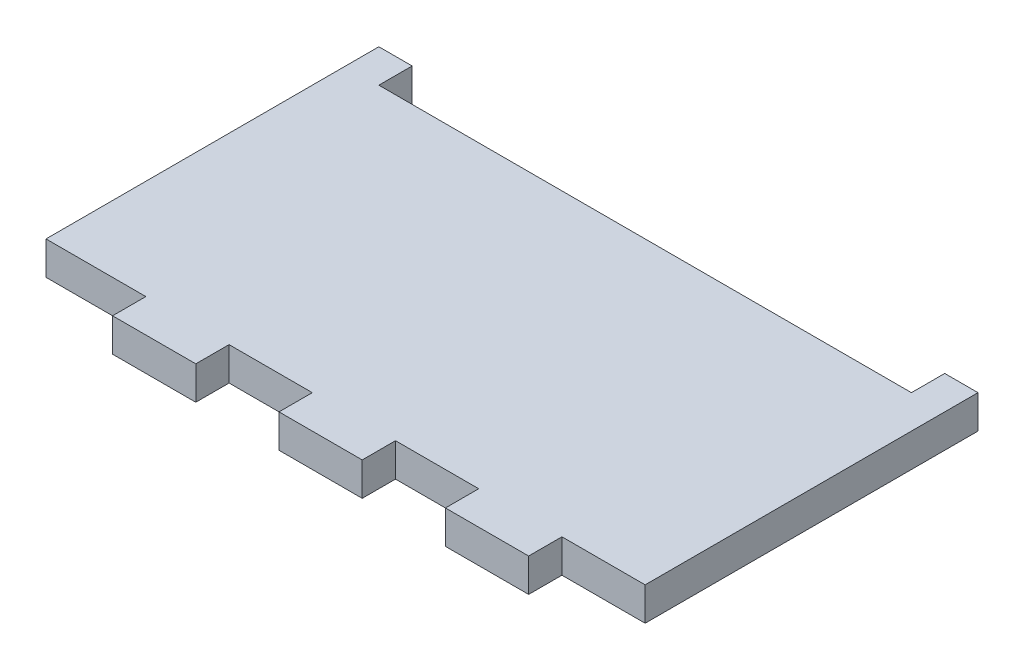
ISO-10303-21;
HEADER;
FILE_DESCRIPTION(('STEP AP214'),'2;1');
FILE_NAME('part.step','',(''),(''),'','','');
FILE_SCHEMA(('AUTOMOTIVE_DESIGN { 1 0 10303 214 1 1 1 1 }'));
ENDSEC;
DATA;
#1=APPLICATION_CONTEXT('core data for automotive mechanical design processes');
#2=APPLICATION_PROTOCOL_DEFINITION('international standard','automotive_design',2000,#1);
#3=PRODUCT_CONTEXT('',#1,'mechanical');
#4=PRODUCT('Part','Part','',(#3));
#5=PRODUCT_RELATED_PRODUCT_CATEGORY('part','',(#4));
#6=PRODUCT_DEFINITION_FORMATION('','',#4);
#7=PRODUCT_DEFINITION_CONTEXT('part definition',#1,'design');
#8=PRODUCT_DEFINITION('design','',#6,#7);
#9=PRODUCT_DEFINITION_SHAPE('','',#8);
#10=(LENGTH_UNIT() NAMED_UNIT(*) SI_UNIT(.MILLI.,.METRE.));
#11=(NAMED_UNIT(*) PLANE_ANGLE_UNIT() SI_UNIT($,.RADIAN.));
#12=(NAMED_UNIT(*) SI_UNIT($,.STERADIAN.) SOLID_ANGLE_UNIT());
#13=UNCERTAINTY_MEASURE_WITH_UNIT(LENGTH_MEASURE(1.E-05),#10,'distance_accuracy_value','');
#14=(GEOMETRIC_REPRESENTATION_CONTEXT(3) GLOBAL_UNCERTAINTY_ASSIGNED_CONTEXT((#13)) GLOBAL_UNIT_ASSIGNED_CONTEXT((#10,
#11,#12)) REPRESENTATION_CONTEXT('',''));
#15=CARTESIAN_POINT('',(0.,0.,0.));
#16=DIRECTION('',(0.,0.,1.));
#17=DIRECTION('',(1.,0.,0.));
#18=AXIS2_PLACEMENT_3D('',#15,#16,#17);
#19=CARTESIAN_POINT('',(0.,0.,18.));
#20=DIRECTION('',(0.,0.,-1.));
#21=DIRECTION('',(0.,-1.,0.));
#22=AXIS2_PLACEMENT_3D('',#19,#20,#21);
#23=PLANE('',#22);
#24=DIRECTION('',(0.,1.,0.));
#25=VECTOR('',#24,1.);
#26=CARTESIAN_POINT('',(-7.00000000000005,-7.49999999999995,18.0000000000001));
#27=LINE('',#26,#25);
#28=CARTESIAN_POINT('',(-7.00000000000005,-7.49999999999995,18.0000000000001));
#29=VERTEX_POINT('',#28);
#30=CARTESIAN_POINT('',(-7.00000000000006,-5.5,18.));
#31=VERTEX_POINT('',#30);
#32=EDGE_CURVE('E51',#29,#31,#27,.T.);
#33=ORIENTED_EDGE('',*,*,#32,.F.);
#34=DIRECTION('',(-1.,0.,0.));
#35=VECTOR('',#34,1.);
#36=CARTESIAN_POINT('',(18.0000000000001,-7.5,18.0000000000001));
#37=LINE('',#36,#35);
#38=CARTESIAN_POINT('',(-2.00000000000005,-7.49999999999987,18.));
#39=VERTEX_POINT('',#38);
#40=EDGE_CURVE('E305',#39,#29,#37,.T.);
#41=ORIENTED_EDGE('',*,*,#40,.F.);
#42=DIRECTION('',(0.,-1.,0.));
#43=VECTOR('',#42,1.);
#44=CARTESIAN_POINT('',(-2.00000000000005,-7.49999999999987,18.));
#45=LINE('',#44,#43);
#46=CARTESIAN_POINT('',(-2.00000000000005,-5.49999999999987,18.));
#47=VERTEX_POINT('',#46);
#48=EDGE_CURVE('E195',#47,#39,#45,.T.);
#49=ORIENTED_EDGE('',*,*,#48,.F.);
#50=DIRECTION('',(1.,0.,0.));
#51=VECTOR('',#50,1.);
#52=CARTESIAN_POINT('',(18.0000000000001,-5.5,18.0000000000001));
#53=LINE('',#52,#51);
#54=EDGE_CURVE('E291',#31,#47,#53,.T.);
#55=ORIENTED_EDGE('',*,*,#54,.F.);
#56=EDGE_LOOP('',(#33,#41,#49,#55));
#57=FACE_BOUND('',#56,.T.);
#58=ADVANCED_FACE('F34',(#57),#23,.F.);
#59=DIRECTION('',(0.,-1.,0.));
#60=VECTOR('',#59,1.);
#61=CARTESIAN_POINT('',(-12.0000000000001,-7.49999999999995,18.0000000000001));
#62=LINE('',#61,#60);
#63=CARTESIAN_POINT('',(-12.0000000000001,-5.49999999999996,18.0000000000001));
#64=VERTEX_POINT('',#63);
#65=CARTESIAN_POINT('',(-12.0000000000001,-7.49999999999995,18.0000000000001));
#66=VERTEX_POINT('',#65);
#67=EDGE_CURVE('E191',#64,#66,#62,.T.);
#68=ORIENTED_EDGE('',*,*,#67,.F.);
#69=CARTESIAN_POINT('',(-18.,-5.50000000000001,18.));
#70=VERTEX_POINT('',#69);
#71=EDGE_CURVE('E43',#70,#64,#53,.T.);
#72=ORIENTED_EDGE('',*,*,#71,.F.);
#73=DIRECTION('',(0.,1.,0.));
#74=VECTOR('',#73,1.);
#75=CARTESIAN_POINT('',(-18.,-7.50000000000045,18.));
#76=LINE('',#75,#74);
#77=CARTESIAN_POINT('',(-18.,-7.5,18.0000000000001));
#78=VERTEX_POINT('',#77);
#79=EDGE_CURVE('E287',#78,#70,#76,.T.);
#80=ORIENTED_EDGE('',*,*,#79,.F.);
#81=EDGE_CURVE('E303',#66,#78,#37,.T.);
#82=ORIENTED_EDGE('',*,*,#81,.F.);
#83=EDGE_LOOP('',(#68,#72,#80,#82));
#84=FACE_BOUND('',#83,.T.);
#85=ADVANCED_FACE('F365',(#84),#23,.F.);
#86=DIRECTION('',(0.,1.,0.));
#87=VECTOR('',#86,1.);
#88=CARTESIAN_POINT('',(2.99999999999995,-7.49999999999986,18.));
#89=LINE('',#88,#87);
#90=CARTESIAN_POINT('',(2.99999999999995,-7.49999999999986,18.));
#91=VERTEX_POINT('',#90);
#92=CARTESIAN_POINT('',(2.99999999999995,-5.5,18.0000000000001));
#93=VERTEX_POINT('',#92);
#94=EDGE_CURVE('E59',#91,#93,#89,.T.);
#95=ORIENTED_EDGE('',*,*,#94,.F.);
#96=CARTESIAN_POINT('',(7.99999999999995,-7.49999999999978,18.));
#97=VERTEX_POINT('',#96);
#98=EDGE_CURVE('E311',#97,#91,#37,.T.);
#99=ORIENTED_EDGE('',*,*,#98,.F.);
#100=DIRECTION('',(0.,-1.,0.));
#101=VECTOR('',#100,1.);
#102=CARTESIAN_POINT('',(7.99999999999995,-7.49999999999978,18.));
#103=LINE('',#102,#101);
#104=CARTESIAN_POINT('',(7.99999999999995,-5.5,18.0000000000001));
#105=VERTEX_POINT('',#104);
#106=EDGE_CURVE('E226',#105,#97,#103,.T.);
#107=ORIENTED_EDGE('',*,*,#106,.F.);
#108=EDGE_CURVE('E330',#93,#105,#53,.T.);
#109=ORIENTED_EDGE('',*,*,#108,.F.);
#110=EDGE_LOOP('',(#95,#99,#107,#109));
#111=FACE_BOUND('',#110,.T.);
#112=ADVANCED_FACE('F324',(#111),#23,.F.);
#113=DIRECTION('',(0.,1.,0.));
#114=VECTOR('',#113,1.);
#115=CARTESIAN_POINT('',(12.9999999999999,-7.49999999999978,18.));
#116=LINE('',#115,#114);
#117=CARTESIAN_POINT('',(12.9999999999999,-7.5,18.0000000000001));
#118=VERTEX_POINT('',#117);
#119=CARTESIAN_POINT('',(12.9999999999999,-5.5,18.0000000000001));
#120=VERTEX_POINT('',#119);
#121=EDGE_CURVE('E221',#118,#120,#116,.T.);
#122=ORIENTED_EDGE('',*,*,#121,.F.);
#123=CARTESIAN_POINT('',(18.,-7.5,18.0000000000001));
#124=VERTEX_POINT('',#123);
#125=EDGE_CURVE('E38',#124,#118,#37,.T.);
#126=ORIENTED_EDGE('',*,*,#125,.F.);
#127=DIRECTION('',(0.,-1.,0.));
#128=VECTOR('',#127,1.);
#129=CARTESIAN_POINT('',(18.,-7.50000000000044,18.0000000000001));
#130=LINE('',#129,#128);
#131=CARTESIAN_POINT('',(18.,-5.5,18.0000000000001));
#132=VERTEX_POINT('',#131);
#133=EDGE_CURVE('E11',#132,#124,#130,.T.);
#134=ORIENTED_EDGE('',*,*,#133,.F.);
#135=EDGE_CURVE('E290',#120,#132,#53,.T.);
#136=ORIENTED_EDGE('',*,*,#135,.F.);
#137=EDGE_LOOP('',(#122,#126,#134,#136));
#138=FACE_BOUND('',#137,.T.);
#139=ADVANCED_FACE('F334',(#138),#23,.F.);
#140=CARTESIAN_POINT('',(0.,0.,0.));
#141=DIRECTION('',(0.,0.,1.));
#142=DIRECTION('',(1.,0.,0.));
#143=AXIS2_PLACEMENT_3D('',#140,#141,#142);
#144=PLANE('',#143);
#145=DIRECTION('',(-1.,0.,0.));
#146=VECTOR('',#145,1.);
#147=CARTESIAN_POINT('',(18.,-5.5,0.));
#148=LINE('',#147,#146);
#149=CARTESIAN_POINT('',(16.,-5.5,0.));
#150=VERTEX_POINT('',#149);
#151=CARTESIAN_POINT('',(-16.,-5.5,0.));
#152=VERTEX_POINT('',#151);
#153=EDGE_CURVE('E286',#150,#152,#148,.T.);
#154=ORIENTED_EDGE('',*,*,#153,.F.);
#155=DIRECTION('',(0.,-1.,0.));
#156=VECTOR('',#155,1.);
#157=CARTESIAN_POINT('',(16.,-5.5,0.));
#158=LINE('',#157,#156);
#159=CARTESIAN_POINT('',(16.,-7.5,0.));
#160=VERTEX_POINT('',#159);
#161=EDGE_CURVE('E248',#150,#160,#158,.T.);
#162=ORIENTED_EDGE('',*,*,#161,.T.);
#163=DIRECTION('',(1.,0.,0.));
#164=VECTOR('',#163,1.);
#165=CARTESIAN_POINT('',(18.,-7.5,0.));
#166=LINE('',#165,#164);
#167=CARTESIAN_POINT('',(-16.,-7.5,0.));
#168=VERTEX_POINT('',#167);
#169=EDGE_CURVE('E294',#168,#160,#166,.T.);
#170=ORIENTED_EDGE('',*,*,#169,.F.);
#171=DIRECTION('',(0.,-1.,0.));
#172=VECTOR('',#171,1.);
#173=CARTESIAN_POINT('',(-16.,-5.5,0.));
#174=LINE('',#173,#172);
#175=EDGE_CURVE('E267',#152,#168,#174,.T.);
#176=ORIENTED_EDGE('',*,*,#175,.F.);
#177=EDGE_LOOP('',(#154,#162,#170,#176));
#178=FACE_BOUND('',#177,.T.);
#179=ADVANCED_FACE('F349',(#178),#144,.F.);
#180=CARTESIAN_POINT('',(18.,-7.5,54.05551275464));
#181=DIRECTION('',(0.,1.,0.));
#182=DIRECTION('',(-1.,0.,0.));
#183=AXIS2_PLACEMENT_3D('',#180,#181,#182);
#184=PLANE('',#183);
#185=DIRECTION('',(0.,0.,-1.));
#186=VECTOR('',#185,1.);
#187=CARTESIAN_POINT('',(-18.,-7.5,54.05551275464));
#188=LINE('',#187,#186);
#189=CARTESIAN_POINT('',(-18.,-7.5,-2.));
#190=VERTEX_POINT('',#189);
#191=EDGE_CURVE('E299',#78,#190,#188,.T.);
#192=ORIENTED_EDGE('',*,*,#191,.T.);
#193=DIRECTION('',(-1.,0.,0.));
#194=VECTOR('',#193,1.);
#195=CARTESIAN_POINT('',(-18.,-7.5,-2.));
#196=LINE('',#195,#194);
#197=CARTESIAN_POINT('',(-16.,-7.5,-2.));
#198=VERTEX_POINT('',#197);
#199=EDGE_CURVE('E275',#198,#190,#196,.T.);
#200=ORIENTED_EDGE('',*,*,#199,.F.);
#201=DIRECTION('',(0.,0.,1.));
#202=VECTOR('',#201,1.);
#203=CARTESIAN_POINT('',(-16.,-7.5,-2.));
#204=LINE('',#203,#202);
#205=EDGE_CURVE('E278',#198,#168,#204,.T.);
#206=ORIENTED_EDGE('',*,*,#205,.T.);
#207=ORIENTED_EDGE('',*,*,#169,.T.);
#208=DIRECTION('',(0.,0.,1.));
#209=VECTOR('',#208,1.);
#210=CARTESIAN_POINT('',(16.,-7.5,-2.));
#211=LINE('',#210,#209);
#212=CARTESIAN_POINT('',(16.,-7.5,-2.));
#213=VERTEX_POINT('',#212);
#214=EDGE_CURVE('E265',#213,#160,#211,.T.);
#215=ORIENTED_EDGE('',*,*,#214,.F.);
#216=DIRECTION('',(1.,0.,0.));
#217=VECTOR('',#216,1.);
#218=CARTESIAN_POINT('',(18.,-7.5,-2.));
#219=LINE('',#218,#217);
#220=CARTESIAN_POINT('',(18.,-7.5,-2.));
#221=VERTEX_POINT('',#220);
#222=EDGE_CURVE('E252',#213,#221,#219,.T.);
#223=ORIENTED_EDGE('',*,*,#222,.T.);
#224=DIRECTION('',(0.,0.,-1.));
#225=VECTOR('',#224,1.);
#226=CARTESIAN_POINT('',(18.,-7.5,54.05551275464));
#227=LINE('',#226,#225);
#228=EDGE_CURVE('E297',#124,#221,#227,.T.);
#229=ORIENTED_EDGE('',*,*,#228,.F.);
#230=ORIENTED_EDGE('',*,*,#125,.T.);
#231=DIRECTION('',(0.,0.,-1.));
#232=VECTOR('',#231,1.);
#233=CARTESIAN_POINT('',(12.9999999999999,-7.49999999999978,20.));
#234=LINE('',#233,#232);
#235=CARTESIAN_POINT('',(12.9999999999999,-7.49999999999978,20.));
#236=VERTEX_POINT('',#235);
#237=EDGE_CURVE('E232',#236,#118,#234,.T.);
#238=ORIENTED_EDGE('',*,*,#237,.F.);
#239=DIRECTION('',(1.,0.,0.));
#240=VECTOR('',#239,1.);
#241=CARTESIAN_POINT('',(12.9999999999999,-7.49999999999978,20.));
#242=LINE('',#241,#240);
#243=CARTESIAN_POINT('',(7.99999999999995,-7.49999999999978,20.));
#244=VERTEX_POINT('',#243);
#245=EDGE_CURVE('E230',#244,#236,#242,.T.);
#246=ORIENTED_EDGE('',*,*,#245,.F.);
#247=DIRECTION('',(0.,0.,-1.));
#248=VECTOR('',#247,1.);
#249=CARTESIAN_POINT('',(7.99999999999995,-7.49999999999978,20.));
#250=LINE('',#249,#248);
#251=EDGE_CURVE('E239',#244,#97,#250,.T.);
#252=ORIENTED_EDGE('',*,*,#251,.T.);
#253=ORIENTED_EDGE('',*,*,#98,.T.);
#254=DIRECTION('',(0.,0.,-1.));
#255=VECTOR('',#254,1.);
#256=CARTESIAN_POINT('',(2.99999999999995,-7.49999999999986,20.));
#257=LINE('',#256,#255);
#258=CARTESIAN_POINT('',(2.99999999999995,-7.49999999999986,20.));
#259=VERTEX_POINT('',#258);
#260=EDGE_CURVE('E209',#259,#91,#257,.T.);
#261=ORIENTED_EDGE('',*,*,#260,.F.);
#262=DIRECTION('',(1.,0.,0.));
#263=VECTOR('',#262,1.);
#264=CARTESIAN_POINT('',(2.99999999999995,-7.49999999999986,20.));
#265=LINE('',#264,#263);
#266=CARTESIAN_POINT('',(-2.00000000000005,-7.49999999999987,20.));
#267=VERTEX_POINT('',#266);
#268=EDGE_CURVE('E208',#267,#259,#265,.T.);
#269=ORIENTED_EDGE('',*,*,#268,.F.);
#270=DIRECTION('',(0.,0.,-1.));
#271=VECTOR('',#270,1.);
#272=CARTESIAN_POINT('',(-2.00000000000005,-7.49999999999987,20.));
#273=LINE('',#272,#271);
#274=EDGE_CURVE('E213',#267,#39,#273,.T.);
#275=ORIENTED_EDGE('',*,*,#274,.T.);
#276=ORIENTED_EDGE('',*,*,#40,.T.);
#277=DIRECTION('',(0.,0.,-1.));
#278=VECTOR('',#277,1.);
#279=CARTESIAN_POINT('',(-7.00000000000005,-7.49999999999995,20.0000000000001));
#280=LINE('',#279,#278);
#281=CARTESIAN_POINT('',(-7.00000000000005,-7.49999999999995,20.0000000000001));
#282=VERTEX_POINT('',#281);
#283=EDGE_CURVE('E372',#282,#29,#280,.T.);
#284=ORIENTED_EDGE('',*,*,#283,.F.);
#285=DIRECTION('',(1.,0.,0.));
#286=VECTOR('',#285,1.);
#287=CARTESIAN_POINT('',(-7.00000000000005,-7.49999999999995,20.0000000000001));
#288=LINE('',#287,#286);
#289=CARTESIAN_POINT('',(-12.0000000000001,-7.49999999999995,20.0000000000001));
#290=VERTEX_POINT('',#289);
#291=EDGE_CURVE('E189',#290,#282,#288,.T.);
#292=ORIENTED_EDGE('',*,*,#291,.F.);
#293=DIRECTION('',(0.,0.,-1.));
#294=VECTOR('',#293,1.);
#295=CARTESIAN_POINT('',(-12.0000000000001,-7.49999999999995,20.0000000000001));
#296=LINE('',#295,#294);
#297=EDGE_CURVE('E197',#290,#66,#296,.T.);
#298=ORIENTED_EDGE('',*,*,#297,.T.);
#299=ORIENTED_EDGE('',*,*,#81,.T.);
#300=EDGE_LOOP('',(#192,#200,#206,#207,#215,#223,#229,#230,#238,#246,#252,#253,#261,#269,#275,
#276,#284,#292,#298,#299));
#301=FACE_BOUND('',#300,.T.);
#302=ADVANCED_FACE('F317',(#301),#184,.F.);
#303=CARTESIAN_POINT('',(-18.,-7.5,54.05551275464));
#304=DIRECTION('',(1.,0.,0.));
#305=DIRECTION('',(0.,1.,0.));
#306=AXIS2_PLACEMENT_3D('',#303,#304,#305);
#307=PLANE('',#306);
#308=DIRECTION('',(0.,0.,-1.));
#309=VECTOR('',#308,1.);
#310=CARTESIAN_POINT('',(-18.,-5.5,54.05551275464));
#311=LINE('',#310,#309);
#312=CARTESIAN_POINT('',(-18.,-5.5,-2.));
#313=VERTEX_POINT('',#312);
#314=EDGE_CURVE('E301',#70,#313,#311,.T.);
#315=ORIENTED_EDGE('',*,*,#314,.T.);
#316=DIRECTION('',(0.,1.,0.));
#317=VECTOR('',#316,1.);
#318=CARTESIAN_POINT('',(-18.,-5.5,-2.));
#319=LINE('',#318,#317);
#320=EDGE_CURVE('E268',#190,#313,#319,.T.);
#321=ORIENTED_EDGE('',*,*,#320,.F.);
#322=ORIENTED_EDGE('',*,*,#191,.F.);
#323=ORIENTED_EDGE('',*,*,#79,.T.);
#324=EDGE_LOOP('',(#315,#321,#322,#323));
#325=FACE_BOUND('',#324,.T.);
#326=ADVANCED_FACE('F362',(#325),#307,.F.);
#327=CARTESIAN_POINT('',(18.,-5.5,54.05551275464));
#328=DIRECTION('',(0.,-1.,0.));
#329=DIRECTION('',(1.,0.,0.));
#330=AXIS2_PLACEMENT_3D('',#327,#328,#329);
#331=PLANE('',#330);
#332=DIRECTION('',(0.,0.,-1.));
#333=VECTOR('',#332,1.);
#334=CARTESIAN_POINT('',(18.,-5.5,54.05551275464));
#335=LINE('',#334,#333);
#336=CARTESIAN_POINT('',(18.,-5.5,-2.));
#337=VERTEX_POINT('',#336);
#338=EDGE_CURVE('E302',#132,#337,#335,.T.);
#339=ORIENTED_EDGE('',*,*,#338,.T.);
#340=DIRECTION('',(-1.,0.,0.));
#341=VECTOR('',#340,1.);
#342=CARTESIAN_POINT('',(18.,-5.5,-2.));
#343=LINE('',#342,#341);
#344=CARTESIAN_POINT('',(16.,-5.5,-2.));
#345=VERTEX_POINT('',#344);
#346=EDGE_CURVE('E258',#337,#345,#343,.T.);
#347=ORIENTED_EDGE('',*,*,#346,.T.);
#348=DIRECTION('',(0.,0.,1.));
#349=VECTOR('',#348,1.);
#350=CARTESIAN_POINT('',(16.,-5.5,-2.));
#351=LINE('',#350,#349);
#352=EDGE_CURVE('E261',#345,#150,#351,.T.);
#353=ORIENTED_EDGE('',*,*,#352,.T.);
#354=ORIENTED_EDGE('',*,*,#153,.T.);
#355=DIRECTION('',(0.,0.,1.));
#356=VECTOR('',#355,1.);
#357=CARTESIAN_POINT('',(-16.,-5.5,-2.));
#358=LINE('',#357,#356);
#359=CARTESIAN_POINT('',(-16.,-5.5,-2.));
#360=VERTEX_POINT('',#359);
#361=EDGE_CURVE('E283',#360,#152,#358,.T.);
#362=ORIENTED_EDGE('',*,*,#361,.F.);
#363=DIRECTION('',(1.,0.,0.));
#364=VECTOR('',#363,1.);
#365=CARTESIAN_POINT('',(-18.,-5.5,-2.));
#366=LINE('',#365,#364);
#367=EDGE_CURVE('E271',#313,#360,#366,.T.);
#368=ORIENTED_EDGE('',*,*,#367,.F.);
#369=ORIENTED_EDGE('',*,*,#314,.F.);
#370=ORIENTED_EDGE('',*,*,#71,.T.);
#371=DIRECTION('',(0.,0.,-1.));
#372=VECTOR('',#371,1.);
#373=CARTESIAN_POINT('',(-12.0000000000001,-5.49999999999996,20.0000000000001));
#374=LINE('',#373,#372);
#375=CARTESIAN_POINT('',(-12.0000000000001,-5.49999999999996,20.0000000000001));
#376=VERTEX_POINT('',#375);
#377=EDGE_CURVE('E180',#376,#64,#374,.T.);
#378=ORIENTED_EDGE('',*,*,#377,.F.);
#379=DIRECTION('',(-1.,0.,0.));
#380=VECTOR('',#379,1.);
#381=CARTESIAN_POINT('',(-7.00000000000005,-5.49999999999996,20.0000000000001));
#382=LINE('',#381,#380);
#383=CARTESIAN_POINT('',(-7.00000000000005,-5.49999999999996,20.0000000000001));
#384=VERTEX_POINT('',#383);
#385=EDGE_CURVE('E174',#384,#376,#382,.T.);
#386=ORIENTED_EDGE('',*,*,#385,.F.);
#387=DIRECTION('',(0.,0.,-1.));
#388=VECTOR('',#387,1.);
#389=CARTESIAN_POINT('',(-7.00000000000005,-5.49999999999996,20.0000000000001));
#390=LINE('',#389,#388);
#391=EDGE_CURVE('E177',#384,#31,#390,.T.);
#392=ORIENTED_EDGE('',*,*,#391,.T.);
#393=ORIENTED_EDGE('',*,*,#54,.T.);
#394=DIRECTION('',(0.,0.,-1.));
#395=VECTOR('',#394,1.);
#396=CARTESIAN_POINT('',(-2.00000000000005,-5.49999999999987,20.));
#397=LINE('',#396,#395);
#398=CARTESIAN_POINT('',(-2.00000000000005,-5.49999999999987,20.));
#399=VERTEX_POINT('',#398);
#400=EDGE_CURVE('E216',#399,#47,#397,.T.);
#401=ORIENTED_EDGE('',*,*,#400,.F.);
#402=DIRECTION('',(-1.,0.,0.));
#403=VECTOR('',#402,1.);
#404=CARTESIAN_POINT('',(2.99999999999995,-5.49999999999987,20.));
#405=LINE('',#404,#403);
#406=CARTESIAN_POINT('',(2.99999999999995,-5.49999999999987,20.));
#407=VERTEX_POINT('',#406);
#408=EDGE_CURVE('E204',#407,#399,#405,.T.);
#409=ORIENTED_EDGE('',*,*,#408,.F.);
#410=DIRECTION('',(0.,0.,-1.));
#411=VECTOR('',#410,1.);
#412=CARTESIAN_POINT('',(2.99999999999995,-5.49999999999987,20.));
#413=LINE('',#412,#411);
#414=EDGE_CURVE('E219',#407,#93,#413,.T.);
#415=ORIENTED_EDGE('',*,*,#414,.T.);
#416=ORIENTED_EDGE('',*,*,#108,.T.);
#417=DIRECTION('',(0.,0.,-1.));
#418=VECTOR('',#417,1.);
#419=CARTESIAN_POINT('',(7.99999999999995,-5.49999999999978,20.));
#420=LINE('',#419,#418);
#421=CARTESIAN_POINT('',(7.99999999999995,-5.49999999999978,20.));
#422=VERTEX_POINT('',#421);
#423=EDGE_CURVE('E242',#422,#105,#420,.T.);
#424=ORIENTED_EDGE('',*,*,#423,.F.);
#425=DIRECTION('',(-1.,0.,0.));
#426=VECTOR('',#425,1.);
#427=CARTESIAN_POINT('',(12.9999999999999,-5.49999999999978,20.));
#428=LINE('',#427,#426);
#429=CARTESIAN_POINT('',(12.9999999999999,-5.49999999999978,20.));
#430=VERTEX_POINT('',#429);
#431=EDGE_CURVE('E225',#430,#422,#428,.T.);
#432=ORIENTED_EDGE('',*,*,#431,.F.);
#433=DIRECTION('',(0.,0.,-1.));
#434=VECTOR('',#433,1.);
#435=CARTESIAN_POINT('',(12.9999999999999,-5.49999999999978,20.));
#436=LINE('',#435,#434);
#437=EDGE_CURVE('E245',#430,#120,#436,.T.);
#438=ORIENTED_EDGE('',*,*,#437,.T.);
#439=ORIENTED_EDGE('',*,*,#135,.T.);
#440=EDGE_LOOP('',(#339,#347,#353,#354,#362,#368,#369,#370,#378,#386,#392,#393,#401,#409,#415,
#416,#424,#432,#438,#439));
#441=FACE_BOUND('',#440,.T.);
#442=ADVANCED_FACE('F176',(#441),#331,.F.);
#443=CARTESIAN_POINT('',(18.,-7.5,54.05551275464));
#444=DIRECTION('',(-1.,0.,0.));
#445=DIRECTION('',(0.,0.,1.));
#446=AXIS2_PLACEMENT_3D('',#443,#444,#445);
#447=PLANE('',#446);
#448=ORIENTED_EDGE('',*,*,#338,.F.);
#449=ORIENTED_EDGE('',*,*,#133,.T.);
#450=ORIENTED_EDGE('',*,*,#228,.T.);
#451=DIRECTION('',(0.,1.,0.));
#452=VECTOR('',#451,1.);
#453=CARTESIAN_POINT('',(18.,-5.5,-2.));
#454=LINE('',#453,#452);
#455=EDGE_CURVE('E249',#221,#337,#454,.T.);
#456=ORIENTED_EDGE('',*,*,#455,.T.);
#457=EDGE_LOOP('',(#448,#449,#450,#456));
#458=FACE_BOUND('',#457,.T.);
#459=ADVANCED_FACE('F36',(#458),#447,.F.);
#460=CARTESIAN_POINT('',(-16.,-5.5,-2.));
#461=DIRECTION('',(-1.,0.,0.));
#462=DIRECTION('',(0.,0.,1.));
#463=AXIS2_PLACEMENT_3D('',#460,#461,#462);
#464=PLANE('',#463);
#465=ORIENTED_EDGE('',*,*,#175,.T.);
#466=ORIENTED_EDGE('',*,*,#205,.F.);
#467=DIRECTION('',(0.,-1.,0.));
#468=VECTOR('',#467,1.);
#469=CARTESIAN_POINT('',(-16.,-5.5,-2.));
#470=LINE('',#469,#468);
#471=EDGE_CURVE('E273',#360,#198,#470,.T.);
#472=ORIENTED_EDGE('',*,*,#471,.F.);
#473=ORIENTED_EDGE('',*,*,#361,.T.);
#474=EDGE_LOOP('',(#465,#466,#472,#473));
#475=FACE_BOUND('',#474,.T.);
#476=ADVANCED_FACE('F353',(#475),#464,.F.);
#477=CARTESIAN_POINT('',(0.,0.,-2.));
#478=DIRECTION('',(0.,0.,1.));
#479=DIRECTION('',(1.,0.,0.));
#480=AXIS2_PLACEMENT_3D('',#477,#478,#479);
#481=PLANE('',#480);
#482=ORIENTED_EDGE('',*,*,#320,.T.);
#483=ORIENTED_EDGE('',*,*,#367,.T.);
#484=ORIENTED_EDGE('',*,*,#471,.T.);
#485=ORIENTED_EDGE('',*,*,#199,.T.);
#486=EDGE_LOOP('',(#482,#483,#484,#485));
#487=FACE_BOUND('',#486,.T.);
#488=ADVANCED_FACE('F358',(#487),#481,.F.);
#489=CARTESIAN_POINT('',(16.,-5.5,-2.));
#490=DIRECTION('',(-1.,0.,0.));
#491=DIRECTION('',(0.,0.,1.));
#492=AXIS2_PLACEMENT_3D('',#489,#490,#491);
#493=PLANE('',#492);
#494=ORIENTED_EDGE('',*,*,#161,.F.);
#495=ORIENTED_EDGE('',*,*,#352,.F.);
#496=DIRECTION('',(0.,-1.,0.));
#497=VECTOR('',#496,1.);
#498=CARTESIAN_POINT('',(16.,-5.5,-2.));
#499=LINE('',#498,#497);
#500=EDGE_CURVE('E255',#345,#213,#499,.T.);
#501=ORIENTED_EDGE('',*,*,#500,.T.);
#502=ORIENTED_EDGE('',*,*,#214,.T.);
#503=EDGE_LOOP('',(#494,#495,#501,#502));
#504=FACE_BOUND('',#503,.T.);
#505=ADVANCED_FACE('F347',(#504),#493,.T.);
#506=CARTESIAN_POINT('',(0.,0.,-2.));
#507=DIRECTION('',(0.,0.,1.));
#508=DIRECTION('',(-1.,0.,0.));
#509=AXIS2_PLACEMENT_3D('',#506,#507,#508);
#510=PLANE('',#509);
#511=ORIENTED_EDGE('',*,*,#455,.F.);
#512=ORIENTED_EDGE('',*,*,#222,.F.);
#513=ORIENTED_EDGE('',*,*,#500,.F.);
#514=ORIENTED_EDGE('',*,*,#346,.F.);
#515=EDGE_LOOP('',(#511,#512,#513,#514));
#516=FACE_BOUND('',#515,.T.);
#517=ADVANCED_FACE('F341',(#516),#510,.F.);
#518=CARTESIAN_POINT('',(12.9999999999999,-7.49999999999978,20.));
#519=DIRECTION('',(-1.,0.,0.));
#520=DIRECTION('',(0.,0.,1.));
#521=AXIS2_PLACEMENT_3D('',#518,#519,#520);
#522=PLANE('',#521);
#523=ORIENTED_EDGE('',*,*,#121,.T.);
#524=ORIENTED_EDGE('',*,*,#437,.F.);
#525=DIRECTION('',(0.,1.,0.));
#526=VECTOR('',#525,1.);
#527=CARTESIAN_POINT('',(12.9999999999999,-7.49999999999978,20.));
#528=LINE('',#527,#526);
#529=EDGE_CURVE('E222',#236,#430,#528,.T.);
#530=ORIENTED_EDGE('',*,*,#529,.F.);
#531=ORIENTED_EDGE('',*,*,#237,.T.);
#532=EDGE_LOOP('',(#523,#524,#530,#531));
#533=FACE_BOUND('',#532,.T.);
#534=ADVANCED_FACE('F430',(#533),#522,.F.);
#535=CARTESIAN_POINT('',(7.99999999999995,-7.49999999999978,20.));
#536=DIRECTION('',(1.,0.,0.));
#537=DIRECTION('',(0.,0.,-1.));
#538=AXIS2_PLACEMENT_3D('',#535,#536,#537);
#539=PLANE('',#538);
#540=ORIENTED_EDGE('',*,*,#106,.T.);
#541=ORIENTED_EDGE('',*,*,#251,.F.);
#542=DIRECTION('',(0.,-1.,0.));
#543=VECTOR('',#542,1.);
#544=CARTESIAN_POINT('',(7.99999999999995,-7.49999999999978,20.));
#545=LINE('',#544,#543);
#546=EDGE_CURVE('E228',#422,#244,#545,.T.);
#547=ORIENTED_EDGE('',*,*,#546,.F.);
#548=ORIENTED_EDGE('',*,*,#423,.T.);
#549=EDGE_LOOP('',(#540,#541,#547,#548));
#550=FACE_BOUND('',#549,.T.);
#551=ADVANCED_FACE('F327',(#550),#539,.F.);
#552=CARTESIAN_POINT('',(0.,0.,20.));
#553=DIRECTION('',(0.,0.,1.));
#554=DIRECTION('',(1.,0.,0.));
#555=AXIS2_PLACEMENT_3D('',#552,#553,#554);
#556=PLANE('',#555);
#557=ORIENTED_EDGE('',*,*,#529,.T.);
#558=ORIENTED_EDGE('',*,*,#431,.T.);
#559=ORIENTED_EDGE('',*,*,#546,.T.);
#560=ORIENTED_EDGE('',*,*,#245,.T.);
#561=EDGE_LOOP('',(#557,#558,#559,#560));
#562=FACE_BOUND('',#561,.T.);
#563=ADVANCED_FACE('F414',(#562),#556,.T.);
#564=CARTESIAN_POINT('',(2.99999999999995,-7.49999999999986,20.));
#565=DIRECTION('',(-1.,0.,0.));
#566=DIRECTION('',(0.,0.,1.));
#567=AXIS2_PLACEMENT_3D('',#564,#565,#566);
#568=PLANE('',#567);
#569=ORIENTED_EDGE('',*,*,#94,.T.);
#570=ORIENTED_EDGE('',*,*,#414,.F.);
#571=DIRECTION('',(0.,1.,0.));
#572=VECTOR('',#571,1.);
#573=CARTESIAN_POINT('',(2.99999999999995,-7.49999999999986,20.));
#574=LINE('',#573,#572);
#575=EDGE_CURVE('E201',#259,#407,#574,.T.);
#576=ORIENTED_EDGE('',*,*,#575,.F.);
#577=ORIENTED_EDGE('',*,*,#260,.T.);
#578=EDGE_LOOP('',(#569,#570,#576,#577));
#579=FACE_BOUND('',#578,.T.);
#580=ADVANCED_FACE('F419',(#579),#568,.F.);
#581=CARTESIAN_POINT('',(-2.00000000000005,-7.49999999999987,20.));
#582=DIRECTION('',(1.,0.,0.));
#583=DIRECTION('',(0.,0.,-1.));
#584=AXIS2_PLACEMENT_3D('',#581,#582,#583);
#585=PLANE('',#584);
#586=ORIENTED_EDGE('',*,*,#48,.T.);
#587=ORIENTED_EDGE('',*,*,#274,.F.);
#588=DIRECTION('',(0.,-1.,0.));
#589=VECTOR('',#588,1.);
#590=CARTESIAN_POINT('',(-2.00000000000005,-7.49999999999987,20.));
#591=LINE('',#590,#589);
#592=EDGE_CURVE('E206',#399,#267,#591,.T.);
#593=ORIENTED_EDGE('',*,*,#592,.F.);
#594=ORIENTED_EDGE('',*,*,#400,.T.);
#595=EDGE_LOOP('',(#586,#587,#593,#594));
#596=FACE_BOUND('',#595,.T.);
#597=ADVANCED_FACE('F539',(#596),#585,.F.);
#598=CARTESIAN_POINT('',(-10.,0.,20.));
#599=DIRECTION('',(0.,0.,1.));
#600=DIRECTION('',(1.,0.,0.));
#601=AXIS2_PLACEMENT_3D('',#598,#599,#600);
#602=PLANE('',#601);
#603=ORIENTED_EDGE('',*,*,#575,.T.);
#604=ORIENTED_EDGE('',*,*,#408,.T.);
#605=ORIENTED_EDGE('',*,*,#592,.T.);
#606=ORIENTED_EDGE('',*,*,#268,.T.);
#607=EDGE_LOOP('',(#603,#604,#605,#606));
#608=FACE_BOUND('',#607,.T.);
#609=ADVANCED_FACE('F382',(#608),#602,.T.);
#610=CARTESIAN_POINT('',(-7.00000000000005,-7.49999999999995,20.0000000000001));
#611=DIRECTION('',(-1.,0.,0.));
#612=DIRECTION('',(0.,0.,1.));
#613=AXIS2_PLACEMENT_3D('',#610,#611,#612);
#614=PLANE('',#613);
#615=ORIENTED_EDGE('',*,*,#32,.T.);
#616=ORIENTED_EDGE('',*,*,#391,.F.);
#617=DIRECTION('',(0.,1.,0.));
#618=VECTOR('',#617,1.);
#619=CARTESIAN_POINT('',(-7.00000000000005,-7.49999999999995,20.0000000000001));
#620=LINE('',#619,#618);
#621=EDGE_CURVE('E184',#282,#384,#620,.T.);
#622=ORIENTED_EDGE('',*,*,#621,.F.);
#623=ORIENTED_EDGE('',*,*,#283,.T.);
#624=EDGE_LOOP('',(#615,#616,#622,#623));
#625=FACE_BOUND('',#624,.T.);
#626=ADVANCED_FACE('F193',(#625),#614,.F.);
#627=CARTESIAN_POINT('',(-12.0000000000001,-7.49999999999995,20.0000000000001));
#628=DIRECTION('',(1.,0.,0.));
#629=DIRECTION('',(0.,0.,-1.));
#630=AXIS2_PLACEMENT_3D('',#627,#628,#629);
#631=PLANE('',#630);
#632=ORIENTED_EDGE('',*,*,#67,.T.);
#633=ORIENTED_EDGE('',*,*,#297,.F.);
#634=DIRECTION('',(0.,-1.,0.));
#635=VECTOR('',#634,1.);
#636=CARTESIAN_POINT('',(-12.0000000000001,-7.49999999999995,20.0000000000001));
#637=LINE('',#636,#635);
#638=EDGE_CURVE('E183',#376,#290,#637,.T.);
#639=ORIENTED_EDGE('',*,*,#638,.F.);
#640=ORIENTED_EDGE('',*,*,#377,.T.);
#641=EDGE_LOOP('',(#632,#633,#639,#640));
#642=FACE_BOUND('',#641,.T.);
#643=ADVANCED_FACE('F373',(#642),#631,.F.);
#644=CARTESIAN_POINT('',(-20.,-1.72137944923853E-13,20.0000000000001));
#645=DIRECTION('',(0.,0.,1.));
#646=DIRECTION('',(1.,0.,0.));
#647=AXIS2_PLACEMENT_3D('',#644,#645,#646);
#648=PLANE('',#647);
#649=ORIENTED_EDGE('',*,*,#621,.T.);
#650=ORIENTED_EDGE('',*,*,#385,.T.);
#651=ORIENTED_EDGE('',*,*,#638,.T.);
#652=ORIENTED_EDGE('',*,*,#291,.T.);
#653=EDGE_LOOP('',(#649,#650,#651,#652));
#654=FACE_BOUND('',#653,.T.);
#655=ADVANCED_FACE('F187',(#654),#648,.T.);
#656=CLOSED_SHELL('',(#58,#85,#112,#139,#179,#302,#326,#442,#459,#476,#488,#505,#517,#534,#551,
#563,#580,#597,#609,#626,#643,#655));
#657=MANIFOLD_SOLID_BREP('B2',#656);
#658=ADVANCED_BREP_SHAPE_REPRESENTATION('',(#18,#657),#14);
#659=SHAPE_DEFINITION_REPRESENTATION(#9,#658);
ENDSEC;
END-ISO-10303-21;
